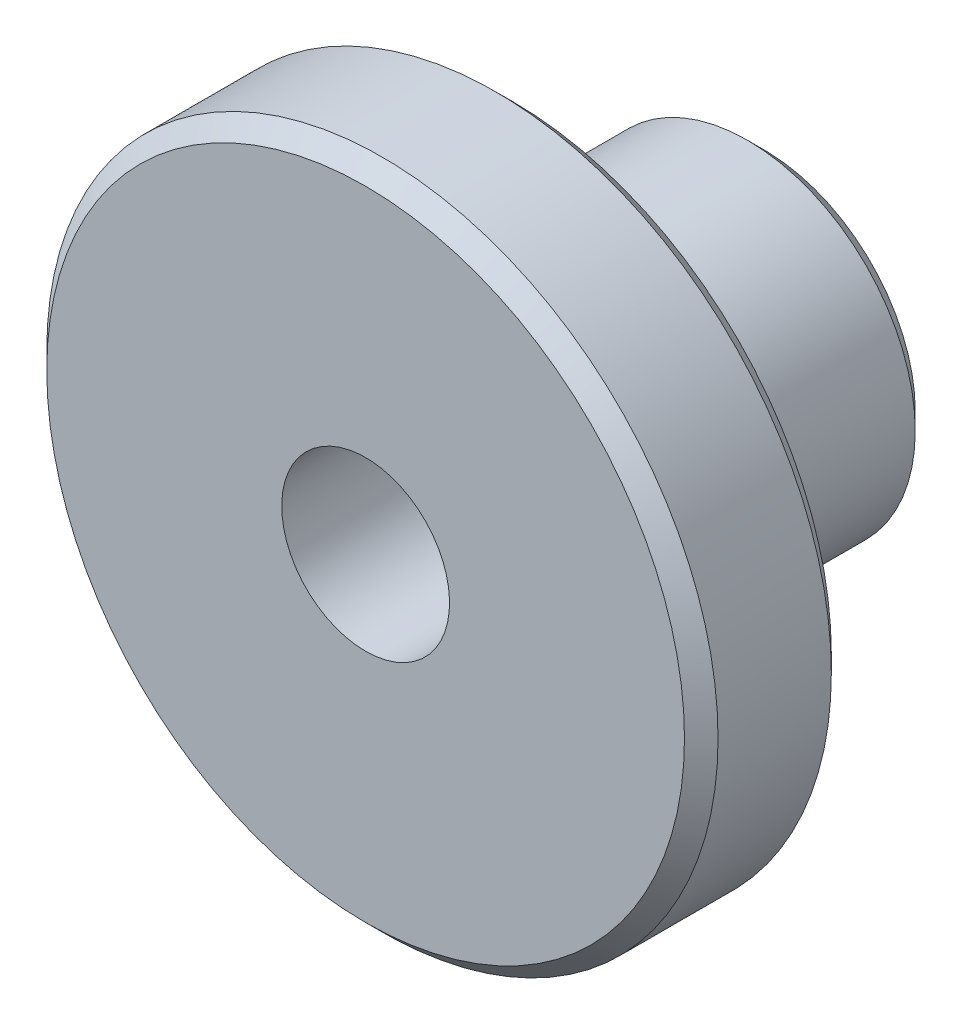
ISO-10303-21;
HEADER;
FILE_DESCRIPTION(('STEP AP214'),'2;1');
FILE_NAME('part.step','',(''),(''),'','','');
FILE_SCHEMA(('AUTOMOTIVE_DESIGN { 1 0 10303 214 1 1 1 1 }'));
ENDSEC;
DATA;
#1=APPLICATION_CONTEXT('core data for automotive mechanical design processes');
#2=APPLICATION_PROTOCOL_DEFINITION('international standard','automotive_design',2000,#1);
#3=PRODUCT_CONTEXT('',#1,'mechanical');
#4=PRODUCT('Part','Part','',(#3));
#5=PRODUCT_RELATED_PRODUCT_CATEGORY('part','',(#4));
#6=PRODUCT_DEFINITION_FORMATION('','',#4);
#7=PRODUCT_DEFINITION_CONTEXT('part definition',#1,'design');
#8=PRODUCT_DEFINITION('design','',#6,#7);
#9=PRODUCT_DEFINITION_SHAPE('','',#8);
#10=(LENGTH_UNIT() NAMED_UNIT(*) SI_UNIT(.MILLI.,.METRE.));
#11=(NAMED_UNIT(*) PLANE_ANGLE_UNIT() SI_UNIT($,.RADIAN.));
#12=(NAMED_UNIT(*) SI_UNIT($,.STERADIAN.) SOLID_ANGLE_UNIT());
#13=UNCERTAINTY_MEASURE_WITH_UNIT(LENGTH_MEASURE(1.E-05),#10,'distance_accuracy_value','');
#14=(GEOMETRIC_REPRESENTATION_CONTEXT(3) GLOBAL_UNCERTAINTY_ASSIGNED_CONTEXT((#13)) GLOBAL_UNIT_ASSIGNED_CONTEXT((#10,
#11,#12)) REPRESENTATION_CONTEXT('',''));
#15=CARTESIAN_POINT('',(0.,0.,0.));
#16=DIRECTION('',(0.,0.,1.));
#17=DIRECTION('',(1.,0.,0.));
#18=AXIS2_PLACEMENT_3D('',#15,#16,#17);
#19=CARTESIAN_POINT('',(-8.123858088,8.096,6.));
#20=DIRECTION('',(0.,0.,1.));
#21=DIRECTION('',(0.,-1.,0.));
#22=AXIS2_PLACEMENT_3D('',#19,#20,#21);
#23=PLANE('',#22);
#24=CARTESIAN_POINT('',(0.,0.,6.));
#25=DIRECTION('',(0.,0.,1.));
#26=DIRECTION('',(1.,0.,0.));
#27=AXIS2_PLACEMENT_3D('',#24,#25,#26);
#28=CIRCLE('',#27,4.5);
#29=CARTESIAN_POINT('',(4.5,0.,6.));
#30=VERTEX_POINT('',#29);
#31=EDGE_CURVE('E8',#30,#30,#28,.T.);
#32=ORIENTED_EDGE('',*,*,#31,.T.);
#33=EDGE_LOOP('',(#32));
#34=FACE_BOUND('',#33,.T.);
#35=CARTESIAN_POINT('',(0.,0.,6.));
#36=DIRECTION('',(0.,0.,1.));
#37=DIRECTION('',(1.,0.,0.));
#38=AXIS2_PLACEMENT_3D('',#35,#36,#37);
#39=CIRCLE('',#38,7.6);
#40=CARTESIAN_POINT('',(7.6,0.,6.));
#41=VERTEX_POINT('',#40);
#42=EDGE_CURVE('E27',#41,#41,#39,.F.);
#43=ORIENTED_EDGE('',*,*,#42,.T.);
#44=EDGE_LOOP('',(#43));
#45=FACE_BOUND('',#44,.T.);
#46=ADVANCED_FACE('F12',(#34,#45),#23,.F.);
#47=CARTESIAN_POINT('',(0.,0.,9.5));
#48=DIRECTION('',(0.,0.,-1.));
#49=DIRECTION('',(0.,1.,0.));
#50=AXIS2_PLACEMENT_3D('',#47,#48,#49);
#51=CYLINDRICAL_SURFACE('',#50,8.);
#52=CARTESIAN_POINT('',(0.,0.,6.4));
#53=DIRECTION('',(0.,0.,1.));
#54=DIRECTION('',(1.,0.,0.));
#55=AXIS2_PLACEMENT_3D('',#52,#53,#54);
#56=CIRCLE('',#55,8.);
#57=CARTESIAN_POINT('',(8.,0.,6.4));
#58=VERTEX_POINT('',#57);
#59=EDGE_CURVE('E32',#58,#58,#56,.T.);
#60=ORIENTED_EDGE('',*,*,#59,.T.);
#61=EDGE_LOOP('',(#60));
#62=FACE_BOUND('',#61,.T.);
#63=CARTESIAN_POINT('',(0.,0.,9.1));
#64=DIRECTION('',(0.,0.,1.));
#65=DIRECTION('',(1.,0.,0.));
#66=AXIS2_PLACEMENT_3D('',#63,#64,#65);
#67=CIRCLE('',#66,8.);
#68=CARTESIAN_POINT('',(8.,0.,9.1));
#69=VERTEX_POINT('',#68);
#70=EDGE_CURVE('E35',#69,#69,#67,.F.);
#71=ORIENTED_EDGE('',*,*,#70,.T.);
#72=EDGE_LOOP('',(#71));
#73=FACE_BOUND('',#72,.T.);
#74=ADVANCED_FACE('F77',(#62,#73),#51,.T.);
#75=CARTESIAN_POINT('',(0.,0.,6.));
#76=DIRECTION('',(0.,0.,-1.));
#77=DIRECTION('',(0.,1.,0.));
#78=AXIS2_PLACEMENT_3D('',#75,#76,#77);
#79=CYLINDRICAL_SURFACE('',#78,4.);
#80=CARTESIAN_POINT('',(0.,0.,5.5));
#81=DIRECTION('',(0.,0.,1.));
#82=DIRECTION('',(1.,0.,0.));
#83=AXIS2_PLACEMENT_3D('',#80,#81,#82);
#84=CIRCLE('',#83,4.);
#85=CARTESIAN_POINT('',(4.,0.,5.5));
#86=VERTEX_POINT('',#85);
#87=EDGE_CURVE('E19',#86,#86,#84,.F.);
#88=ORIENTED_EDGE('',*,*,#87,.T.);
#89=EDGE_LOOP('',(#88));
#90=FACE_BOUND('',#89,.T.);
#91=CARTESIAN_POINT('',(0.,0.,0.4));
#92=DIRECTION('',(0.,0.,1.));
#93=DIRECTION('',(1.,0.,0.));
#94=AXIS2_PLACEMENT_3D('',#91,#92,#93);
#95=CIRCLE('',#94,4.);
#96=CARTESIAN_POINT('',(4.,0.,0.4));
#97=VERTEX_POINT('',#96);
#98=EDGE_CURVE('E41',#97,#97,#95,.T.);
#99=ORIENTED_EDGE('',*,*,#98,.T.);
#100=EDGE_LOOP('',(#99));
#101=FACE_BOUND('',#100,.T.);
#102=ADVANCED_FACE('F73',(#90,#101),#79,.T.);
#103=CARTESIAN_POINT('',(-8.123858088,8.096,9.5));
#104=DIRECTION('',(0.,0.,1.));
#105=DIRECTION('',(0.,-1.,0.));
#106=AXIS2_PLACEMENT_3D('',#103,#104,#105);
#107=PLANE('',#106);
#108=CARTESIAN_POINT('',(0.,0.,9.5));
#109=DIRECTION('',(0.,0.,1.));
#110=DIRECTION('',(1.,0.,0.));
#111=AXIS2_PLACEMENT_3D('',#108,#109,#110);
#112=CIRCLE('',#111,7.6);
#113=CARTESIAN_POINT('',(7.6,0.,9.5));
#114=VERTEX_POINT('',#113);
#115=EDGE_CURVE('E23',#114,#114,#112,.T.);
#116=ORIENTED_EDGE('',*,*,#115,.T.);
#117=EDGE_LOOP('',(#116));
#118=FACE_BOUND('',#117,.T.);
#119=CARTESIAN_POINT('',(0.,0.,9.5));
#120=DIRECTION('',(0.,0.,1.));
#121=DIRECTION('',(0.,-1.,0.));
#122=AXIS2_PLACEMENT_3D('',#119,#120,#121);
#123=CIRCLE('',#122,2.);
#124=CARTESIAN_POINT('',(0.,-2.,9.5));
#125=VERTEX_POINT('',#124);
#126=EDGE_CURVE('E45',#125,#125,#123,.F.);
#127=ORIENTED_EDGE('',*,*,#126,.T.);
#128=EDGE_LOOP('',(#127));
#129=FACE_BOUND('',#128,.T.);
#130=ADVANCED_FACE('F67',(#118,#129),#107,.T.);
#131=CARTESIAN_POINT('',(-4.061929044,4.048,0.));
#132=DIRECTION('',(0.,0.,1.));
#133=DIRECTION('',(0.,-1.,0.));
#134=AXIS2_PLACEMENT_3D('',#131,#132,#133);
#135=PLANE('',#134);
#136=CARTESIAN_POINT('',(0.,0.,0.));
#137=DIRECTION('',(0.,0.,1.));
#138=DIRECTION('',(1.,0.,0.));
#139=AXIS2_PLACEMENT_3D('',#136,#137,#138);
#140=CIRCLE('',#139,3.6);
#141=CARTESIAN_POINT('',(3.6,0.,0.));
#142=VERTEX_POINT('',#141);
#143=EDGE_CURVE('E38',#142,#142,#140,.F.);
#144=ORIENTED_EDGE('',*,*,#143,.T.);
#145=EDGE_LOOP('',(#144));
#146=FACE_BOUND('',#145,.T.);
#147=CARTESIAN_POINT('',(0.,0.,0.));
#148=DIRECTION('',(0.,0.,1.));
#149=DIRECTION('',(0.,-1.,0.));
#150=AXIS2_PLACEMENT_3D('',#147,#148,#149);
#151=CIRCLE('',#150,2.);
#152=CARTESIAN_POINT('',(0.,-2.,0.));
#153=VERTEX_POINT('',#152);
#154=EDGE_CURVE('E44',#153,#153,#151,.T.);
#155=ORIENTED_EDGE('',*,*,#154,.T.);
#156=EDGE_LOOP('',(#155));
#157=FACE_BOUND('',#156,.T.);
#158=ADVANCED_FACE('F51',(#146,#157),#135,.F.);
#159=CARTESIAN_POINT('',(0.,0.,0.));
#160=DIRECTION('',(0.,0.,1.));
#161=DIRECTION('',(0.,-1.,0.));
#162=AXIS2_PLACEMENT_3D('',#159,#160,#161);
#163=CYLINDRICAL_SURFACE('',#162,2.);
#164=ORIENTED_EDGE('',*,*,#126,.F.);
#165=EDGE_LOOP('',(#164));
#166=FACE_BOUND('',#165,.T.);
#167=ORIENTED_EDGE('',*,*,#154,.F.);
#168=EDGE_LOOP('',(#167));
#169=FACE_BOUND('',#168,.T.);
#170=ADVANCED_FACE('F53',(#166,#169),#163,.F.);
#171=CARTESIAN_POINT('',(0.,0.,0.4));
#172=DIRECTION('',(0.,0.,1.));
#173=DIRECTION('',(1.,0.,0.));
#174=AXIS2_PLACEMENT_3D('',#171,#172,#173);
#175=CONICAL_SURFACE('',#174,4.,0.785398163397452);
#176=ORIENTED_EDGE('',*,*,#143,.F.);
#177=EDGE_LOOP('',(#176));
#178=FACE_BOUND('',#177,.T.);
#179=ORIENTED_EDGE('',*,*,#98,.F.);
#180=EDGE_LOOP('',(#179));
#181=FACE_BOUND('',#180,.T.);
#182=ADVANCED_FACE('F55',(#178,#181),#175,.T.);
#183=CARTESIAN_POINT('',(0.,0.,6.4));
#184=DIRECTION('',(0.,0.,1.));
#185=DIRECTION('',(1.,0.,0.));
#186=AXIS2_PLACEMENT_3D('',#183,#184,#185);
#187=CONICAL_SURFACE('',#186,8.,0.78539816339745);
#188=ORIENTED_EDGE('',*,*,#42,.F.);
#189=EDGE_LOOP('',(#188));
#190=FACE_BOUND('',#189,.T.);
#191=ORIENTED_EDGE('',*,*,#59,.F.);
#192=EDGE_LOOP('',(#191));
#193=FACE_BOUND('',#192,.T.);
#194=ADVANCED_FACE('F64',(#190,#193),#187,.T.);
#195=CARTESIAN_POINT('',(0.,0.,9.5));
#196=DIRECTION('',(0.,0.,-1.));
#197=DIRECTION('',(-1.,0.,0.));
#198=AXIS2_PLACEMENT_3D('',#195,#196,#197);
#199=CONICAL_SURFACE('',#198,7.6,0.785398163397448);
#200=ORIENTED_EDGE('',*,*,#70,.F.);
#201=EDGE_LOOP('',(#200));
#202=FACE_BOUND('',#201,.T.);
#203=ORIENTED_EDGE('',*,*,#115,.F.);
#204=EDGE_LOOP('',(#203));
#205=FACE_BOUND('',#204,.T.);
#206=ADVANCED_FACE('F82',(#202,#205),#199,.T.);
#207=CARTESIAN_POINT('',(0.,0.,5.5));
#208=DIRECTION('',(0.,0.,1.));
#209=DIRECTION('',(1.,0.,0.));
#210=AXIS2_PLACEMENT_3D('',#207,#208,#209);
#211=TOROIDAL_SURFACE('',#210,4.5,0.5);
#212=ORIENTED_EDGE('',*,*,#31,.F.);
#213=EDGE_LOOP('',(#212));
#214=FACE_BOUND('',#213,.T.);
#215=ORIENTED_EDGE('',*,*,#87,.F.);
#216=EDGE_LOOP('',(#215));
#217=FACE_BOUND('',#216,.T.);
#218=ADVANCED_FACE('F14',(#214,#217),#211,.F.);
#219=CLOSED_SHELL('',(#46,#74,#102,#130,#158,#170,#182,#194,#206,#218));
#220=MANIFOLD_SOLID_BREP('B1',#219);
#221=ADVANCED_BREP_SHAPE_REPRESENTATION('',(#18,#220),#14);
#222=SHAPE_DEFINITION_REPRESENTATION(#9,#221);
ENDSEC;
END-ISO-10303-21;
